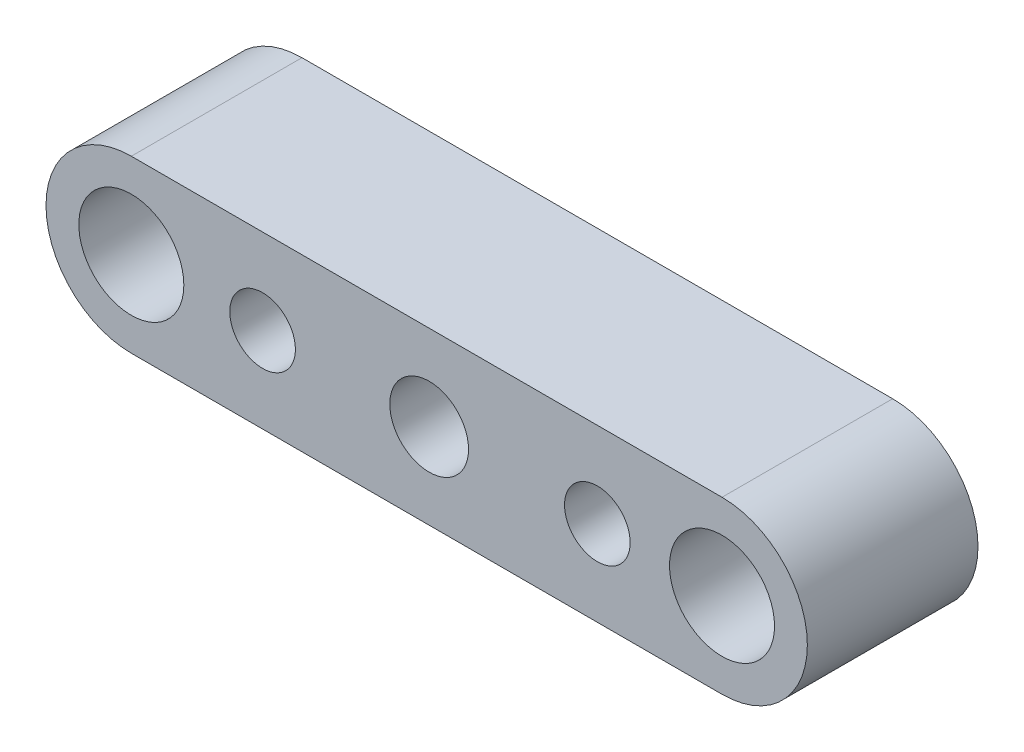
from build123d import *

# Parameters (mm, degrees)
Y_KSEKLIK_EKSTR_ZYON1_DEPTH = 13
IZIM2_R                     = 2.5
IZIM2_R_2                   = 3
KES_EKSTR_ZYON1_DEPTH       = 13
IZIM3_R                     = 4
KES_EKSTR_ZYON2_DEPTH       = 13


with BuildPart() as part:
    # izim1 → Y_kseklik-Ekstr_zyon1 (new body)
    with BuildSketch(Plane.XY):
        with BuildLine():
            Line((0, 6.5), (45, 6.5))
            ThreePointArc((45, 6.5), (51.5, 0), (45, -6.5))
            Line((45, -6.5), (0, -6.5))
            ThreePointArc((0, -6.5), (-6.5, 0), (0, 6.5))
        make_face()
    extrude(amount=Y_KSEKLIK_EKSTR_ZYON1_DEPTH)

    # izim2 → Kes-Ekstr_zyon1 (cut)
    with BuildSketch(Plane.XY.offset(13)):
        with Locations((10, 0)):
            Circle(IZIM2_R)
        with Locations((35.5, 0)):
            Circle(IZIM2_R)
        with Locations((22.689082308, 0)):
            Circle(IZIM2_R_2)
    extrude(amount=-KES_EKSTR_ZYON1_DEPTH, mode=Mode.SUBTRACT)

    # izim3 → Kes-Ekstr_zyon2 (cut)
    with BuildSketch(Plane.XY.offset(13)):
        Circle(IZIM3_R)
        with Locations((45, 0)):
            Circle(IZIM3_R)
    extrude(amount=-KES_EKSTR_ZYON2_DEPTH, mode=Mode.SUBTRACT)


solid = part.part
